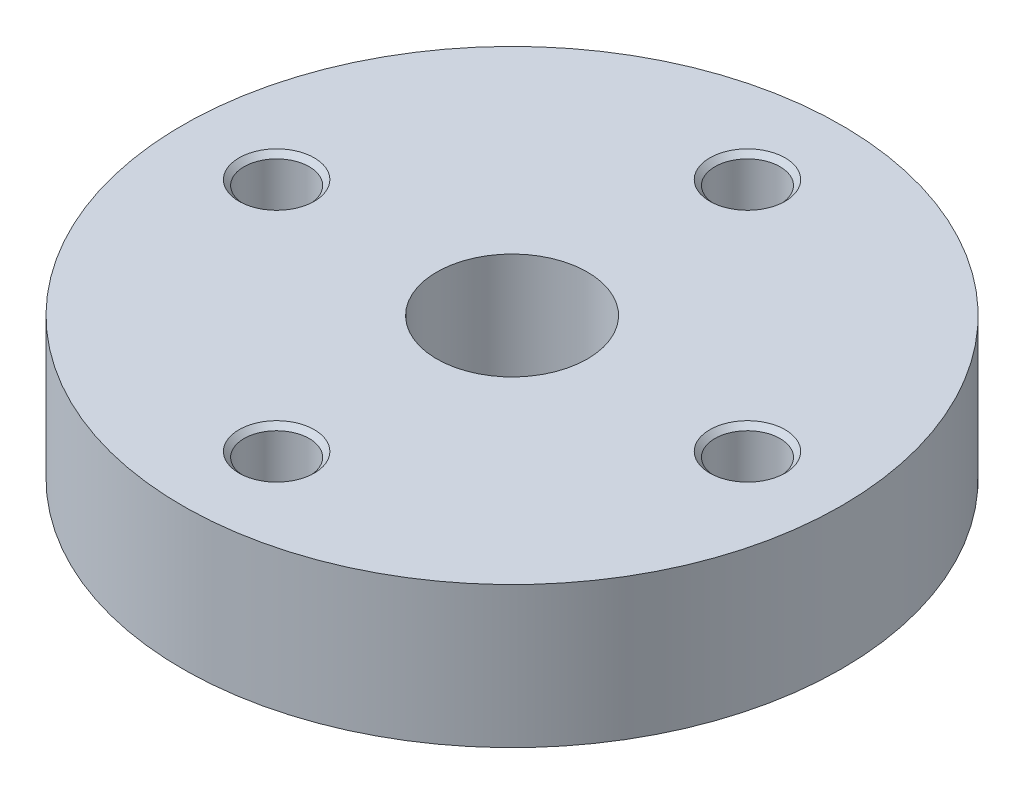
ISO-10303-21;
HEADER;
FILE_DESCRIPTION(('STEP AP214'),'2;1');
FILE_NAME('part.step','',(''),(''),'','','');
FILE_SCHEMA(('AUTOMOTIVE_DESIGN { 1 0 10303 214 1 1 1 1 }'));
ENDSEC;
DATA;
#1=APPLICATION_CONTEXT('core data for automotive mechanical design processes');
#2=APPLICATION_PROTOCOL_DEFINITION('international standard','automotive_design',2000,#1);
#3=PRODUCT_CONTEXT('',#1,'mechanical');
#4=PRODUCT('Part','Part','',(#3));
#5=PRODUCT_RELATED_PRODUCT_CATEGORY('part','',(#4));
#6=PRODUCT_DEFINITION_FORMATION('','',#4);
#7=PRODUCT_DEFINITION_CONTEXT('part definition',#1,'design');
#8=PRODUCT_DEFINITION('design','',#6,#7);
#9=PRODUCT_DEFINITION_SHAPE('','',#8);
#10=(LENGTH_UNIT() NAMED_UNIT(*) SI_UNIT(.MILLI.,.METRE.));
#11=(NAMED_UNIT(*) PLANE_ANGLE_UNIT() SI_UNIT($,.RADIAN.));
#12=(NAMED_UNIT(*) SI_UNIT($,.STERADIAN.) SOLID_ANGLE_UNIT());
#13=UNCERTAINTY_MEASURE_WITH_UNIT(LENGTH_MEASURE(1.E-05),#10,'distance_accuracy_value','');
#14=(GEOMETRIC_REPRESENTATION_CONTEXT(3) GLOBAL_UNCERTAINTY_ASSIGNED_CONTEXT((#13)) GLOBAL_UNIT_ASSIGNED_CONTEXT((#10,
#11,#12)) REPRESENTATION_CONTEXT('',''));
#15=CARTESIAN_POINT('',(0.,0.,0.));
#16=DIRECTION('',(0.,0.,1.));
#17=DIRECTION('',(1.,0.,0.));
#18=AXIS2_PLACEMENT_3D('',#15,#16,#17);
#19=CARTESIAN_POINT('',(0.,15.,0.));
#20=DIRECTION('',(0.,-1.,0.));
#21=DIRECTION('',(1.,0.,0.));
#22=AXIS2_PLACEMENT_3D('',#19,#20,#21);
#23=CYLINDRICAL_SURFACE('',#22,70.);
#24=CARTESIAN_POINT('',(0.,0.,0.));
#25=DIRECTION('',(0.,1.,0.));
#26=DIRECTION('',(1.,0.,0.));
#27=AXIS2_PLACEMENT_3D('',#24,#25,#26);
#28=CIRCLE('',#27,70.);
#29=CARTESIAN_POINT('',(70.,0.,0.));
#30=VERTEX_POINT('',#29);
#31=EDGE_CURVE('E9',#30,#30,#28,.T.);
#32=ORIENTED_EDGE('',*,*,#31,.T.);
#33=EDGE_LOOP('',(#32));
#34=FACE_BOUND('',#33,.T.);
#35=CARTESIAN_POINT('',(0.,30.,0.));
#36=DIRECTION('',(0.,1.,0.));
#37=DIRECTION('',(1.,0.,0.));
#38=AXIS2_PLACEMENT_3D('',#35,#36,#37);
#39=CIRCLE('',#38,70.);
#40=CARTESIAN_POINT('',(70.,30.,0.));
#41=VERTEX_POINT('',#40);
#42=EDGE_CURVE('E175',#41,#41,#39,.T.);
#43=ORIENTED_EDGE('',*,*,#42,.F.);
#44=EDGE_LOOP('',(#43));
#45=FACE_BOUND('',#44,.T.);
#46=ADVANCED_FACE('F15',(#34,#45),#23,.T.);
#47=CARTESIAN_POINT('',(43.,0.,0.));
#48=DIRECTION('',(0.,-1.,0.));
#49=DIRECTION('',(-1.,0.,0.));
#50=AXIS2_PLACEMENT_3D('',#47,#48,#49);
#51=PLANE('',#50);
#52=CARTESIAN_POINT('',(0.,0.,0.));
#53=DIRECTION('',(0.,1.,0.));
#54=DIRECTION('',(1.,0.,0.));
#55=AXIS2_PLACEMENT_3D('',#52,#53,#54);
#56=CIRCLE('',#55,16.);
#57=CARTESIAN_POINT('',(16.,0.,0.));
#58=VERTEX_POINT('',#57);
#59=EDGE_CURVE('E22',#58,#58,#56,.T.);
#60=ORIENTED_EDGE('',*,*,#59,.T.);
#61=EDGE_LOOP('',(#60));
#62=FACE_BOUND('',#61,.T.);
#63=ORIENTED_EDGE('',*,*,#31,.F.);
#64=EDGE_LOOP('',(#63));
#65=FACE_BOUND('',#64,.T.);
#66=ADVANCED_FACE('F181',(#62,#65),#51,.T.);
#67=CARTESIAN_POINT('',(0.,15.,0.));
#68=DIRECTION('',(0.,-1.,0.));
#69=DIRECTION('',(1.,0.,0.));
#70=AXIS2_PLACEMENT_3D('',#67,#68,#69);
#71=CYLINDRICAL_SURFACE('',#70,16.);
#72=CARTESIAN_POINT('',(0.,30.,0.));
#73=DIRECTION('',(0.,1.,0.));
#74=DIRECTION('',(1.,0.,0.));
#75=AXIS2_PLACEMENT_3D('',#72,#73,#74);
#76=CIRCLE('',#75,16.);
#77=CARTESIAN_POINT('',(16.,30.,0.));
#78=VERTEX_POINT('',#77);
#79=EDGE_CURVE('E173',#78,#78,#76,.T.);
#80=ORIENTED_EDGE('',*,*,#79,.T.);
#81=EDGE_LOOP('',(#80));
#82=FACE_BOUND('',#81,.T.);
#83=ORIENTED_EDGE('',*,*,#59,.F.);
#84=EDGE_LOOP('',(#83));
#85=FACE_BOUND('',#84,.T.);
#86=ADVANCED_FACE('F186',(#82,#85),#71,.F.);
#87=CARTESIAN_POINT('',(43.,30.,0.));
#88=DIRECTION('',(0.,1.,0.));
#89=DIRECTION('',(1.,0.,0.));
#90=AXIS2_PLACEMENT_3D('',#87,#88,#89);
#91=PLANE('',#90);
#92=ORIENTED_EDGE('',*,*,#42,.T.);
#93=EDGE_LOOP('',(#92));
#94=FACE_BOUND('',#93,.T.);
#95=ORIENTED_EDGE('',*,*,#79,.F.);
#96=EDGE_LOOP('',(#95));
#97=FACE_BOUND('',#96,.T.);
#98=CARTESIAN_POINT('',(50.,30.,0.));
#99=DIRECTION('',(0.,-1.,0.));
#100=DIRECTION('',(1.,0.,0.));
#101=AXIS2_PLACEMENT_3D('',#98,#99,#100);
#102=CIRCLE('',#101,8.);
#103=CARTESIAN_POINT('',(58.,30.,0.));
#104=VERTEX_POINT('',#103);
#105=EDGE_CURVE('E143',#104,#104,#102,.T.);
#106=ORIENTED_EDGE('',*,*,#105,.T.);
#107=EDGE_LOOP('',(#106));
#108=FACE_BOUND('',#107,.T.);
#109=CARTESIAN_POINT('',(0.,30.,-50.));
#110=DIRECTION('',(0.,-1.,0.));
#111=DIRECTION('',(0.,0.,-1.));
#112=AXIS2_PLACEMENT_3D('',#109,#110,#111);
#113=CIRCLE('',#112,8.);
#114=CARTESIAN_POINT('',(0.,30.,-58.));
#115=VERTEX_POINT('',#114);
#116=EDGE_CURVE('E150',#115,#115,#113,.T.);
#117=ORIENTED_EDGE('',*,*,#116,.T.);
#118=EDGE_LOOP('',(#117));
#119=FACE_BOUND('',#118,.T.);
#120=CARTESIAN_POINT('',(-50.,30.,0.));
#121=DIRECTION('',(0.,-1.,0.));
#122=DIRECTION('',(-1.,0.,0.));
#123=AXIS2_PLACEMENT_3D('',#120,#121,#122);
#124=CIRCLE('',#123,8.);
#125=CARTESIAN_POINT('',(-58.,30.,0.));
#126=VERTEX_POINT('',#125);
#127=EDGE_CURVE('E121',#126,#126,#124,.T.);
#128=ORIENTED_EDGE('',*,*,#127,.T.);
#129=EDGE_LOOP('',(#128));
#130=FACE_BOUND('',#129,.T.);
#131=CARTESIAN_POINT('',(0.,30.,50.));
#132=DIRECTION('',(0.,-1.,0.));
#133=DIRECTION('',(0.,0.,1.));
#134=AXIS2_PLACEMENT_3D('',#131,#132,#133);
#135=CIRCLE('',#134,8.);
#136=CARTESIAN_POINT('',(0.,30.,58.));
#137=VERTEX_POINT('',#136);
#138=EDGE_CURVE('E137',#137,#137,#135,.T.);
#139=ORIENTED_EDGE('',*,*,#138,.T.);
#140=EDGE_LOOP('',(#139));
#141=FACE_BOUND('',#140,.T.);
#142=ADVANCED_FACE('F122',(#94,#97,#108,#119,#130,#141),#91,.T.);
#143=CARTESIAN_POINT('',(50.,5.00308975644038,0.));
#144=DIRECTION('',(0.,1.,0.));
#145=DIRECTION('',(1.,0.,0.));
#146=AXIS2_PLACEMENT_3D('',#143,#144,#145);
#147=CONICAL_SURFACE('',#146,3.45875,1.0471975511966);
#148=CARTESIAN_POINT('',(50.,7.,0.));
#149=DIRECTION('',(0.,-1.,0.));
#150=DIRECTION('',(1.,0.,0.));
#151=AXIS2_PLACEMENT_3D('',#148,#149,#150);
#152=CIRCLE('',#151,6.9175);
#153=CARTESIAN_POINT('',(56.9175,7.,0.));
#154=VERTEX_POINT('',#153);
#155=EDGE_CURVE('E171',#154,#154,#152,.T.);
#156=ORIENTED_EDGE('',*,*,#155,.F.);
#157=EDGE_LOOP('',(#156));
#158=FACE_BOUND('',#157,.T.);
#159=CARTESIAN_POINT('',(50.,3.00617951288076,0.));
#160=VERTEX_POINT('',#159);
#161=VERTEX_LOOP('',#160);
#162=FACE_BOUND('',#161,.T.);
#163=ADVANCED_FACE('F196',(#158,#162),#147,.F.);
#164=CARTESIAN_POINT('',(50.,9.95875,0.));
#165=DIRECTION('',(0.,1.,0.));
#166=DIRECTION('',(1.,0.,0.));
#167=AXIS2_PLACEMENT_3D('',#164,#165,#166);
#168=CYLINDRICAL_SURFACE('',#167,6.9175);
#169=CARTESIAN_POINT('',(50.,12.9175,0.));
#170=DIRECTION('',(0.,-1.,0.));
#171=DIRECTION('',(1.,0.,0.));
#172=AXIS2_PLACEMENT_3D('',#169,#170,#171);
#173=CIRCLE('',#172,6.9175);
#174=CARTESIAN_POINT('',(56.9175,12.9175,0.));
#175=VERTEX_POINT('',#174);
#176=EDGE_CURVE('E169',#175,#175,#173,.T.);
#177=ORIENTED_EDGE('',*,*,#176,.F.);
#178=EDGE_LOOP('',(#177));
#179=FACE_BOUND('',#178,.T.);
#180=ORIENTED_EDGE('',*,*,#155,.T.);
#181=EDGE_LOOP('',(#180));
#182=FACE_BOUND('',#181,.T.);
#183=ADVANCED_FACE('F199',(#179,#182),#168,.F.);
#184=CARTESIAN_POINT('',(50.,13.45875,0.));
#185=DIRECTION('',(0.,1.,0.));
#186=DIRECTION('',(1.,0.,0.));
#187=AXIS2_PLACEMENT_3D('',#184,#185,#186);
#188=CONICAL_SURFACE('',#187,7.45875,0.785398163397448);
#189=CARTESIAN_POINT('',(50.,14.,0.));
#190=DIRECTION('',(0.,-1.,0.));
#191=DIRECTION('',(1.,0.,0.));
#192=AXIS2_PLACEMENT_3D('',#189,#190,#191);
#193=CIRCLE('',#192,8.);
#194=CARTESIAN_POINT('',(58.,14.,0.));
#195=VERTEX_POINT('',#194);
#196=EDGE_CURVE('E142',#195,#195,#193,.T.);
#197=ORIENTED_EDGE('',*,*,#196,.F.);
#198=EDGE_LOOP('',(#197));
#199=FACE_BOUND('',#198,.T.);
#200=ORIENTED_EDGE('',*,*,#176,.T.);
#201=EDGE_LOOP('',(#200));
#202=FACE_BOUND('',#201,.T.);
#203=ADVANCED_FACE('F203',(#199,#202),#188,.F.);
#204=CARTESIAN_POINT('',(57.45875,14.,0.));
#205=DIRECTION('',(0.,1.,0.));
#206=DIRECTION('',(-1.,0.,0.));
#207=AXIS2_PLACEMENT_3D('',#204,#205,#206);
#208=PLANE('',#207);
#209=CARTESIAN_POINT('',(50.,14.,0.));
#210=DIRECTION('',(0.,-1.,0.));
#211=DIRECTION('',(1.,0.,0.));
#212=AXIS2_PLACEMENT_3D('',#209,#210,#211);
#213=CIRCLE('',#212,6.9175);
#214=CARTESIAN_POINT('',(56.9175,14.,0.));
#215=VERTEX_POINT('',#214);
#216=EDGE_CURVE('E140',#215,#215,#213,.T.);
#217=ORIENTED_EDGE('',*,*,#216,.F.);
#218=EDGE_LOOP('',(#217));
#219=FACE_BOUND('',#218,.T.);
#220=ORIENTED_EDGE('',*,*,#196,.T.);
#221=EDGE_LOOP('',(#220));
#222=FACE_BOUND('',#221,.T.);
#223=ADVANCED_FACE('F205',(#219,#222),#208,.F.);
#224=CARTESIAN_POINT('',(50.,21.45875,0.));
#225=DIRECTION('',(0.,1.,0.));
#226=DIRECTION('',(1.,0.,0.));
#227=AXIS2_PLACEMENT_3D('',#224,#225,#226);
#228=CYLINDRICAL_SURFACE('',#227,6.9175);
#229=CARTESIAN_POINT('',(50.,28.9175,0.));
#230=DIRECTION('',(0.,-1.,0.));
#231=DIRECTION('',(1.,0.,0.));
#232=AXIS2_PLACEMENT_3D('',#229,#230,#231);
#233=CIRCLE('',#232,6.9175);
#234=CARTESIAN_POINT('',(56.9175,28.9175,0.));
#235=VERTEX_POINT('',#234);
#236=EDGE_CURVE('E165',#235,#235,#233,.T.);
#237=ORIENTED_EDGE('',*,*,#236,.F.);
#238=EDGE_LOOP('',(#237));
#239=FACE_BOUND('',#238,.T.);
#240=ORIENTED_EDGE('',*,*,#216,.T.);
#241=EDGE_LOOP('',(#240));
#242=FACE_BOUND('',#241,.T.);
#243=ADVANCED_FACE('F208',(#239,#242),#228,.F.);
#244=CARTESIAN_POINT('',(50.,29.45875,0.));
#245=DIRECTION('',(0.,1.,0.));
#246=DIRECTION('',(1.,0.,0.));
#247=AXIS2_PLACEMENT_3D('',#244,#245,#246);
#248=CONICAL_SURFACE('',#247,7.45875,0.785398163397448);
#249=ORIENTED_EDGE('',*,*,#105,.F.);
#250=EDGE_LOOP('',(#249));
#251=FACE_BOUND('',#250,.T.);
#252=ORIENTED_EDGE('',*,*,#236,.T.);
#253=EDGE_LOOP('',(#252));
#254=FACE_BOUND('',#253,.T.);
#255=ADVANCED_FACE('F212',(#251,#254),#248,.F.);
#256=CARTESIAN_POINT('',(0.,5.00308975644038,-50.));
#257=DIRECTION('',(0.,1.,0.));
#258=DIRECTION('',(0.,0.,-1.));
#259=AXIS2_PLACEMENT_3D('',#256,#257,#258);
#260=CONICAL_SURFACE('',#259,3.45875,1.0471975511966);
#261=CARTESIAN_POINT('',(0.,7.,-50.));
#262=DIRECTION('',(0.,-1.,0.));
#263=DIRECTION('',(0.,0.,-1.));
#264=AXIS2_PLACEMENT_3D('',#261,#262,#263);
#265=CIRCLE('',#264,6.9175);
#266=CARTESIAN_POINT('',(0.,7.,-56.9175));
#267=VERTEX_POINT('',#266);
#268=EDGE_CURVE('E163',#267,#267,#265,.T.);
#269=ORIENTED_EDGE('',*,*,#268,.F.);
#270=EDGE_LOOP('',(#269));
#271=FACE_BOUND('',#270,.T.);
#272=CARTESIAN_POINT('',(0.,3.00617951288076,-50.));
#273=VERTEX_POINT('',#272);
#274=VERTEX_LOOP('',#273);
#275=FACE_BOUND('',#274,.T.);
#276=ADVANCED_FACE('F216',(#271,#275),#260,.F.);
#277=CARTESIAN_POINT('',(0.,9.95875,-50.));
#278=DIRECTION('',(0.,1.,0.));
#279=DIRECTION('',(0.,0.,-1.));
#280=AXIS2_PLACEMENT_3D('',#277,#278,#279);
#281=CYLINDRICAL_SURFACE('',#280,6.9175);
#282=CARTESIAN_POINT('',(0.,12.9175,-50.));
#283=DIRECTION('',(0.,-1.,0.));
#284=DIRECTION('',(0.,0.,-1.));
#285=AXIS2_PLACEMENT_3D('',#282,#283,#284);
#286=CIRCLE('',#285,6.9175);
#287=CARTESIAN_POINT('',(0.,12.9175,-56.9175));
#288=VERTEX_POINT('',#287);
#289=EDGE_CURVE('E161',#288,#288,#286,.T.);
#290=ORIENTED_EDGE('',*,*,#289,.F.);
#291=EDGE_LOOP('',(#290));
#292=FACE_BOUND('',#291,.T.);
#293=ORIENTED_EDGE('',*,*,#268,.T.);
#294=EDGE_LOOP('',(#293));
#295=FACE_BOUND('',#294,.T.);
#296=ADVANCED_FACE('F220',(#292,#295),#281,.F.);
#297=CARTESIAN_POINT('',(0.,13.45875,-50.));
#298=DIRECTION('',(0.,1.,0.));
#299=DIRECTION('',(0.,0.,-1.));
#300=AXIS2_PLACEMENT_3D('',#297,#298,#299);
#301=CONICAL_SURFACE('',#300,7.45875,0.785398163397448);
#302=CARTESIAN_POINT('',(0.,14.,-50.));
#303=DIRECTION('',(0.,-1.,0.));
#304=DIRECTION('',(0.,0.,-1.));
#305=AXIS2_PLACEMENT_3D('',#302,#303,#304);
#306=CIRCLE('',#305,8.);
#307=CARTESIAN_POINT('',(0.,14.,-58.));
#308=VERTEX_POINT('',#307);
#309=EDGE_CURVE('E159',#308,#308,#306,.T.);
#310=ORIENTED_EDGE('',*,*,#309,.F.);
#311=EDGE_LOOP('',(#310));
#312=FACE_BOUND('',#311,.T.);
#313=ORIENTED_EDGE('',*,*,#289,.T.);
#314=EDGE_LOOP('',(#313));
#315=FACE_BOUND('',#314,.T.);
#316=ADVANCED_FACE('F224',(#312,#315),#301,.F.);
#317=CARTESIAN_POINT('',(0.,14.,-57.45875));
#318=DIRECTION('',(0.,1.,0.));
#319=DIRECTION('',(0.,0.,1.));
#320=AXIS2_PLACEMENT_3D('',#317,#318,#319);
#321=PLANE('',#320);
#322=CARTESIAN_POINT('',(0.,14.,-50.));
#323=DIRECTION('',(0.,-1.,0.));
#324=DIRECTION('',(0.,0.,-1.));
#325=AXIS2_PLACEMENT_3D('',#322,#323,#324);
#326=CIRCLE('',#325,6.9175);
#327=CARTESIAN_POINT('',(0.,14.,-56.9175));
#328=VERTEX_POINT('',#327);
#329=EDGE_CURVE('E156',#328,#328,#326,.T.);
#330=ORIENTED_EDGE('',*,*,#329,.F.);
#331=EDGE_LOOP('',(#330));
#332=FACE_BOUND('',#331,.T.);
#333=ORIENTED_EDGE('',*,*,#309,.T.);
#334=EDGE_LOOP('',(#333));
#335=FACE_BOUND('',#334,.T.);
#336=ADVANCED_FACE('F228',(#332,#335),#321,.F.);
#337=CARTESIAN_POINT('',(0.,21.45875,-50.));
#338=DIRECTION('',(0.,1.,0.));
#339=DIRECTION('',(0.,0.,-1.));
#340=AXIS2_PLACEMENT_3D('',#337,#338,#339);
#341=CYLINDRICAL_SURFACE('',#340,6.9175);
#342=CARTESIAN_POINT('',(0.,28.9175,-50.));
#343=DIRECTION('',(0.,-1.,0.));
#344=DIRECTION('',(0.,0.,-1.));
#345=AXIS2_PLACEMENT_3D('',#342,#343,#344);
#346=CIRCLE('',#345,6.9175);
#347=CARTESIAN_POINT('',(0.,28.9175,-56.9175));
#348=VERTEX_POINT('',#347);
#349=EDGE_CURVE('E148',#348,#348,#346,.T.);
#350=ORIENTED_EDGE('',*,*,#349,.F.);
#351=EDGE_LOOP('',(#350));
#352=FACE_BOUND('',#351,.T.);
#353=ORIENTED_EDGE('',*,*,#329,.T.);
#354=EDGE_LOOP('',(#353));
#355=FACE_BOUND('',#354,.T.);
#356=ADVANCED_FACE('F232',(#352,#355),#341,.F.);
#357=CARTESIAN_POINT('',(0.,29.45875,-50.));
#358=DIRECTION('',(0.,1.,0.));
#359=DIRECTION('',(0.,0.,-1.));
#360=AXIS2_PLACEMENT_3D('',#357,#358,#359);
#361=CONICAL_SURFACE('',#360,7.45875,0.785398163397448);
#362=ORIENTED_EDGE('',*,*,#116,.F.);
#363=EDGE_LOOP('',(#362));
#364=FACE_BOUND('',#363,.T.);
#365=ORIENTED_EDGE('',*,*,#349,.T.);
#366=EDGE_LOOP('',(#365));
#367=FACE_BOUND('',#366,.T.);
#368=ADVANCED_FACE('F236',(#364,#367),#361,.F.);
#369=CARTESIAN_POINT('',(-50.,5.00308975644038,0.));
#370=DIRECTION('',(0.,1.,0.));
#371=DIRECTION('',(-1.,0.,0.));
#372=AXIS2_PLACEMENT_3D('',#369,#370,#371);
#373=CONICAL_SURFACE('',#372,3.45875,1.0471975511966);
#374=CARTESIAN_POINT('',(-50.,7.,0.));
#375=DIRECTION('',(0.,-1.,0.));
#376=DIRECTION('',(-1.,0.,0.));
#377=AXIS2_PLACEMENT_3D('',#374,#375,#376);
#378=CIRCLE('',#377,6.9175);
#379=CARTESIAN_POINT('',(-56.9175,7.,0.));
#380=VERTEX_POINT('',#379);
#381=EDGE_CURVE('E151',#380,#380,#378,.T.);
#382=ORIENTED_EDGE('',*,*,#381,.F.);
#383=EDGE_LOOP('',(#382));
#384=FACE_BOUND('',#383,.T.);
#385=CARTESIAN_POINT('',(-50.,3.00617951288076,0.));
#386=VERTEX_POINT('',#385);
#387=VERTEX_LOOP('',#386);
#388=FACE_BOUND('',#387,.T.);
#389=ADVANCED_FACE('F238',(#384,#388),#373,.F.);
#390=CARTESIAN_POINT('',(-50.,9.95875,0.));
#391=DIRECTION('',(0.,1.,0.));
#392=DIRECTION('',(-1.,0.,0.));
#393=AXIS2_PLACEMENT_3D('',#390,#391,#392);
#394=CYLINDRICAL_SURFACE('',#393,6.9175);
#395=CARTESIAN_POINT('',(-50.,12.9175,0.));
#396=DIRECTION('',(0.,-1.,0.));
#397=DIRECTION('',(-1.,0.,0.));
#398=AXIS2_PLACEMENT_3D('',#395,#396,#397);
#399=CIRCLE('',#398,6.9175);
#400=CARTESIAN_POINT('',(-56.9175,12.9175,0.));
#401=VERTEX_POINT('',#400);
#402=EDGE_CURVE('E153',#401,#401,#399,.T.);
#403=ORIENTED_EDGE('',*,*,#402,.F.);
#404=EDGE_LOOP('',(#403));
#405=FACE_BOUND('',#404,.T.);
#406=ORIENTED_EDGE('',*,*,#381,.T.);
#407=EDGE_LOOP('',(#406));
#408=FACE_BOUND('',#407,.T.);
#409=ADVANCED_FACE('F241',(#405,#408),#394,.F.);
#410=CARTESIAN_POINT('',(-50.,13.45875,0.));
#411=DIRECTION('',(0.,1.,0.));
#412=DIRECTION('',(-1.,0.,0.));
#413=AXIS2_PLACEMENT_3D('',#410,#411,#412);
#414=CONICAL_SURFACE('',#413,7.45875,0.785398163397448);
#415=CARTESIAN_POINT('',(-50.,14.,0.));
#416=DIRECTION('',(0.,-1.,0.));
#417=DIRECTION('',(-1.,0.,0.));
#418=AXIS2_PLACEMENT_3D('',#415,#416,#417);
#419=CIRCLE('',#418,8.);
#420=CARTESIAN_POINT('',(-58.,14.,0.));
#421=VERTEX_POINT('',#420);
#422=EDGE_CURVE('E128',#421,#421,#419,.T.);
#423=ORIENTED_EDGE('',*,*,#422,.F.);
#424=EDGE_LOOP('',(#423));
#425=FACE_BOUND('',#424,.T.);
#426=ORIENTED_EDGE('',*,*,#402,.T.);
#427=EDGE_LOOP('',(#426));
#428=FACE_BOUND('',#427,.T.);
#429=ADVANCED_FACE('F245',(#425,#428),#414,.F.);
#430=CARTESIAN_POINT('',(-57.45875,14.,0.));
#431=DIRECTION('',(0.,1.,0.));
#432=DIRECTION('',(1.,0.,0.));
#433=AXIS2_PLACEMENT_3D('',#430,#431,#432);
#434=PLANE('',#433);
#435=CARTESIAN_POINT('',(-50.,14.,0.));
#436=DIRECTION('',(0.,-1.,0.));
#437=DIRECTION('',(-1.,0.,0.));
#438=AXIS2_PLACEMENT_3D('',#435,#436,#437);
#439=CIRCLE('',#438,6.9175);
#440=CARTESIAN_POINT('',(-56.9175,14.,0.));
#441=VERTEX_POINT('',#440);
#442=EDGE_CURVE('E125',#441,#441,#439,.T.);
#443=ORIENTED_EDGE('',*,*,#442,.F.);
#444=EDGE_LOOP('',(#443));
#445=FACE_BOUND('',#444,.T.);
#446=ORIENTED_EDGE('',*,*,#422,.T.);
#447=EDGE_LOOP('',(#446));
#448=FACE_BOUND('',#447,.T.);
#449=ADVANCED_FACE('F247',(#445,#448),#434,.F.);
#450=CARTESIAN_POINT('',(-50.,21.45875,0.));
#451=DIRECTION('',(0.,1.,0.));
#452=DIRECTION('',(-1.,0.,0.));
#453=AXIS2_PLACEMENT_3D('',#450,#451,#452);
#454=CYLINDRICAL_SURFACE('',#453,6.9175);
#455=CARTESIAN_POINT('',(-50.,28.9175,0.));
#456=DIRECTION('',(0.,-1.,0.));
#457=DIRECTION('',(-1.,0.,0.));
#458=AXIS2_PLACEMENT_3D('',#455,#456,#457);
#459=CIRCLE('',#458,6.9175);
#460=CARTESIAN_POINT('',(-56.9175,28.9175,0.));
#461=VERTEX_POINT('',#460);
#462=EDGE_CURVE('E126',#461,#461,#459,.T.);
#463=ORIENTED_EDGE('',*,*,#462,.F.);
#464=EDGE_LOOP('',(#463));
#465=FACE_BOUND('',#464,.T.);
#466=ORIENTED_EDGE('',*,*,#442,.T.);
#467=EDGE_LOOP('',(#466));
#468=FACE_BOUND('',#467,.T.);
#469=ADVANCED_FACE('F250',(#465,#468),#454,.F.);
#470=CARTESIAN_POINT('',(-50.,29.45875,0.));
#471=DIRECTION('',(0.,1.,0.));
#472=DIRECTION('',(-1.,0.,0.));
#473=AXIS2_PLACEMENT_3D('',#470,#471,#472);
#474=CONICAL_SURFACE('',#473,7.45875,0.785398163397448);
#475=ORIENTED_EDGE('',*,*,#127,.F.);
#476=EDGE_LOOP('',(#475));
#477=FACE_BOUND('',#476,.T.);
#478=ORIENTED_EDGE('',*,*,#462,.T.);
#479=EDGE_LOOP('',(#478));
#480=FACE_BOUND('',#479,.T.);
#481=ADVANCED_FACE('F257',(#477,#480),#474,.F.);
#482=CARTESIAN_POINT('',(0.,5.00308975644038,50.));
#483=DIRECTION('',(0.,1.,0.));
#484=DIRECTION('',(0.,0.,1.));
#485=AXIS2_PLACEMENT_3D('',#482,#483,#484);
#486=CONICAL_SURFACE('',#485,3.45875,1.0471975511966);
#487=CARTESIAN_POINT('',(0.,7.,50.));
#488=DIRECTION('',(0.,-1.,0.));
#489=DIRECTION('',(0.,0.,1.));
#490=AXIS2_PLACEMENT_3D('',#487,#488,#489);
#491=CIRCLE('',#490,6.9175);
#492=CARTESIAN_POINT('',(0.,7.,56.9175));
#493=VERTEX_POINT('',#492);
#494=EDGE_CURVE('E130',#493,#493,#491,.T.);
#495=ORIENTED_EDGE('',*,*,#494,.F.);
#496=EDGE_LOOP('',(#495));
#497=FACE_BOUND('',#496,.T.);
#498=CARTESIAN_POINT('',(0.,3.00617951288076,50.));
#499=VERTEX_POINT('',#498);
#500=VERTEX_LOOP('',#499);
#501=FACE_BOUND('',#500,.T.);
#502=ADVANCED_FACE('F259',(#497,#501),#486,.F.);
#503=CARTESIAN_POINT('',(0.,9.95875,50.));
#504=DIRECTION('',(0.,1.,0.));
#505=DIRECTION('',(0.,0.,1.));
#506=AXIS2_PLACEMENT_3D('',#503,#504,#505);
#507=CYLINDRICAL_SURFACE('',#506,6.9175);
#508=CARTESIAN_POINT('',(0.,12.9175,50.));
#509=DIRECTION('',(0.,-1.,0.));
#510=DIRECTION('',(0.,0.,1.));
#511=AXIS2_PLACEMENT_3D('',#508,#509,#510);
#512=CIRCLE('',#511,6.9175);
#513=CARTESIAN_POINT('',(0.,12.9175,56.9175));
#514=VERTEX_POINT('',#513);
#515=EDGE_CURVE('E134',#514,#514,#512,.T.);
#516=ORIENTED_EDGE('',*,*,#515,.F.);
#517=EDGE_LOOP('',(#516));
#518=FACE_BOUND('',#517,.T.);
#519=ORIENTED_EDGE('',*,*,#494,.T.);
#520=EDGE_LOOP('',(#519));
#521=FACE_BOUND('',#520,.T.);
#522=ADVANCED_FACE('F262',(#518,#521),#507,.F.);
#523=CARTESIAN_POINT('',(0.,13.45875,50.));
#524=DIRECTION('',(0.,1.,0.));
#525=DIRECTION('',(0.,0.,1.));
#526=AXIS2_PLACEMENT_3D('',#523,#524,#525);
#527=CONICAL_SURFACE('',#526,7.45875,0.785398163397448);
#528=CARTESIAN_POINT('',(0.,14.,50.));
#529=DIRECTION('',(0.,-1.,0.));
#530=DIRECTION('',(0.,0.,1.));
#531=AXIS2_PLACEMENT_3D('',#528,#529,#530);
#532=CIRCLE('',#531,8.);
#533=CARTESIAN_POINT('',(0.,14.,58.));
#534=VERTEX_POINT('',#533);
#535=EDGE_CURVE('E145',#534,#534,#532,.T.);
#536=ORIENTED_EDGE('',*,*,#535,.F.);
#537=EDGE_LOOP('',(#536));
#538=FACE_BOUND('',#537,.T.);
#539=ORIENTED_EDGE('',*,*,#515,.T.);
#540=EDGE_LOOP('',(#539));
#541=FACE_BOUND('',#540,.T.);
#542=ADVANCED_FACE('F267',(#538,#541),#527,.F.);
#543=CARTESIAN_POINT('',(0.,14.,57.45875));
#544=DIRECTION('',(0.,1.,0.));
#545=DIRECTION('',(0.,0.,-1.));
#546=AXIS2_PLACEMENT_3D('',#543,#544,#545);
#547=PLANE('',#546);
#548=CARTESIAN_POINT('',(0.,14.,50.));
#549=DIRECTION('',(0.,-1.,0.));
#550=DIRECTION('',(0.,0.,1.));
#551=AXIS2_PLACEMENT_3D('',#548,#549,#550);
#552=CIRCLE('',#551,6.9175);
#553=CARTESIAN_POINT('',(0.,14.,56.9175));
#554=VERTEX_POINT('',#553);
#555=EDGE_CURVE('E138',#554,#554,#552,.T.);
#556=ORIENTED_EDGE('',*,*,#555,.F.);
#557=EDGE_LOOP('',(#556));
#558=FACE_BOUND('',#557,.T.);
#559=ORIENTED_EDGE('',*,*,#535,.T.);
#560=EDGE_LOOP('',(#559));
#561=FACE_BOUND('',#560,.T.);
#562=ADVANCED_FACE('F270',(#558,#561),#547,.F.);
#563=CARTESIAN_POINT('',(0.,21.45875,50.));
#564=DIRECTION('',(0.,1.,0.));
#565=DIRECTION('',(0.,0.,1.));
#566=AXIS2_PLACEMENT_3D('',#563,#564,#565);
#567=CYLINDRICAL_SURFACE('',#566,6.9175);
#568=CARTESIAN_POINT('',(0.,28.9175,50.));
#569=DIRECTION('',(0.,-1.,0.));
#570=DIRECTION('',(0.,0.,1.));
#571=AXIS2_PLACEMENT_3D('',#568,#569,#570);
#572=CIRCLE('',#571,6.9175);
#573=CARTESIAN_POINT('',(0.,28.9175,56.9175));
#574=VERTEX_POINT('',#573);
#575=EDGE_CURVE('E135',#574,#574,#572,.T.);
#576=ORIENTED_EDGE('',*,*,#575,.F.);
#577=EDGE_LOOP('',(#576));
#578=FACE_BOUND('',#577,.T.);
#579=ORIENTED_EDGE('',*,*,#555,.T.);
#580=EDGE_LOOP('',(#579));
#581=FACE_BOUND('',#580,.T.);
#582=ADVANCED_FACE('F274',(#578,#581),#567,.F.);
#583=CARTESIAN_POINT('',(0.,29.45875,50.));
#584=DIRECTION('',(0.,1.,0.));
#585=DIRECTION('',(0.,0.,1.));
#586=AXIS2_PLACEMENT_3D('',#583,#584,#585);
#587=CONICAL_SURFACE('',#586,7.45875,0.785398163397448);
#588=ORIENTED_EDGE('',*,*,#138,.F.);
#589=EDGE_LOOP('',(#588));
#590=FACE_BOUND('',#589,.T.);
#591=ORIENTED_EDGE('',*,*,#575,.T.);
#592=EDGE_LOOP('',(#591));
#593=FACE_BOUND('',#592,.T.);
#594=ADVANCED_FACE('F278',(#590,#593),#587,.F.);
#595=CLOSED_SHELL('',(#46,#66,#86,#142,#163,#183,#203,#223,#243,#255,#276,#296,#316,#336,#356,
#368,#389,#409,#429,#449,#469,#481,#502,#522,#542,#562,#582,#594));
#596=MANIFOLD_SOLID_BREP('B1',#595);
#597=ADVANCED_BREP_SHAPE_REPRESENTATION('',(#18,#596),#14);
#598=SHAPE_DEFINITION_REPRESENTATION(#9,#597);
ENDSEC;
END-ISO-10303-21;
